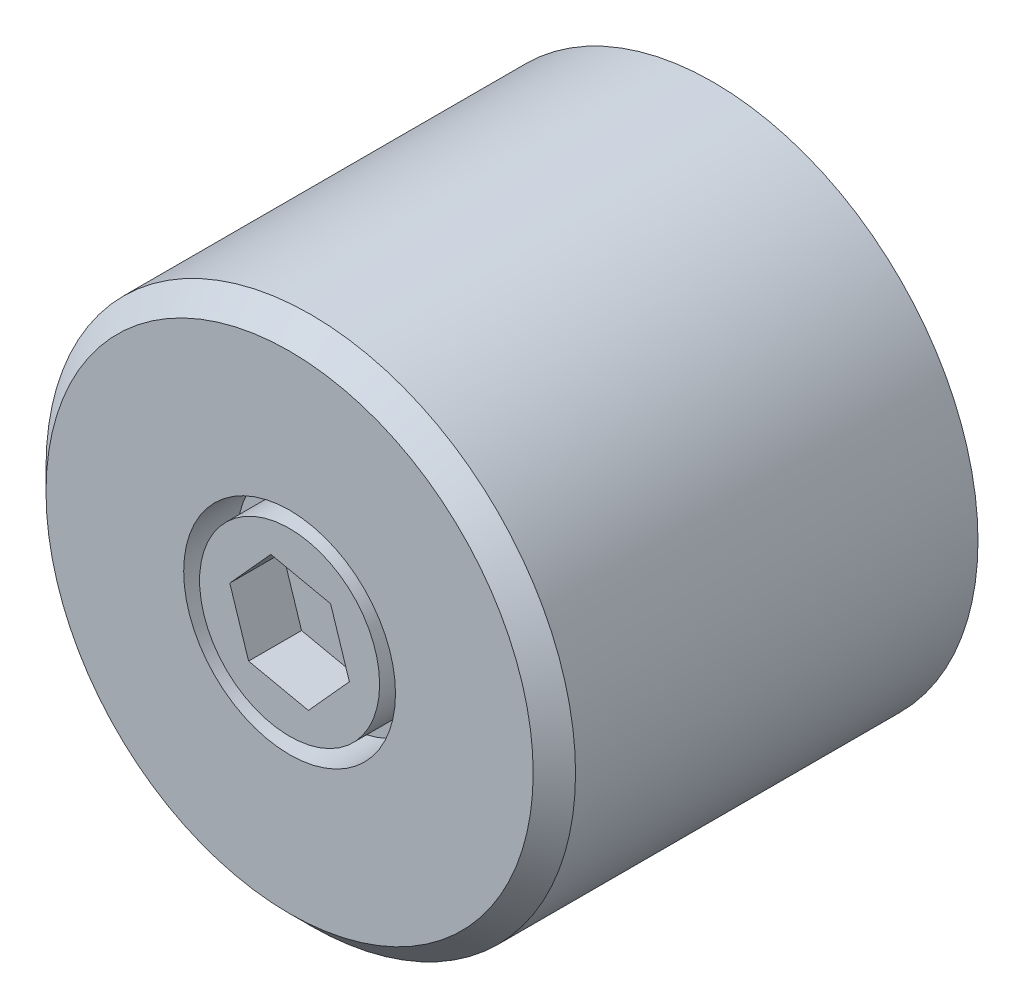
ISO-10303-21;
HEADER;
FILE_DESCRIPTION(('STEP AP214'),'2;1');
FILE_NAME('part.step','',(''),(''),'','','');
FILE_SCHEMA(('AUTOMOTIVE_DESIGN { 1 0 10303 214 1 1 1 1 }'));
ENDSEC;
DATA;
#1=APPLICATION_CONTEXT('core data for automotive mechanical design processes');
#2=APPLICATION_PROTOCOL_DEFINITION('international standard','automotive_design',2000,#1);
#3=PRODUCT_CONTEXT('',#1,'mechanical');
#4=PRODUCT('Part','Part','',(#3));
#5=PRODUCT_RELATED_PRODUCT_CATEGORY('part','',(#4));
#6=PRODUCT_DEFINITION_FORMATION('','',#4);
#7=PRODUCT_DEFINITION_CONTEXT('part definition',#1,'design');
#8=PRODUCT_DEFINITION('design','',#6,#7);
#9=PRODUCT_DEFINITION_SHAPE('','',#8);
#10=(LENGTH_UNIT() NAMED_UNIT(*) SI_UNIT(.MILLI.,.METRE.));
#11=(NAMED_UNIT(*) PLANE_ANGLE_UNIT() SI_UNIT($,.RADIAN.));
#12=(NAMED_UNIT(*) SI_UNIT($,.STERADIAN.) SOLID_ANGLE_UNIT());
#13=UNCERTAINTY_MEASURE_WITH_UNIT(LENGTH_MEASURE(1.E-05),#10,'distance_accuracy_value','');
#14=(GEOMETRIC_REPRESENTATION_CONTEXT(3) GLOBAL_UNCERTAINTY_ASSIGNED_CONTEXT((#13)) GLOBAL_UNIT_ASSIGNED_CONTEXT((#10,
#11,#12)) REPRESENTATION_CONTEXT('',''));
#15=CARTESIAN_POINT('',(0.,0.,0.));
#16=DIRECTION('',(0.,0.,1.));
#17=DIRECTION('',(1.,0.,0.));
#18=AXIS2_PLACEMENT_3D('',#15,#16,#17);
#19=CARTESIAN_POINT('',(0.,0.,40.));
#20=DIRECTION('',(0.,0.,-1.));
#21=DIRECTION('',(-1.,0.,0.));
#22=AXIS2_PLACEMENT_3D('',#19,#20,#21);
#23=CYLINDRICAL_SURFACE('',#22,25.);
#24=CARTESIAN_POINT('',(0.,0.,38.));
#25=DIRECTION('',(0.,0.,1.));
#26=DIRECTION('',(1.,0.,0.));
#27=AXIS2_PLACEMENT_3D('',#24,#25,#26);
#28=CIRCLE('',#27,25.);
#29=CARTESIAN_POINT('',(25.,0.,38.));
#30=VERTEX_POINT('',#29);
#31=EDGE_CURVE('E12',#30,#30,#28,.F.);
#32=ORIENTED_EDGE('',*,*,#31,.T.);
#33=EDGE_LOOP('',(#32));
#34=FACE_BOUND('',#33,.T.);
#35=CARTESIAN_POINT('',(0.,0.,0.));
#36=DIRECTION('',(0.,0.,1.));
#37=DIRECTION('',(1.,0.,0.));
#38=AXIS2_PLACEMENT_3D('',#35,#36,#37);
#39=CIRCLE('',#38,25.);
#40=CARTESIAN_POINT('',(25.,0.,0.));
#41=VERTEX_POINT('',#40);
#42=EDGE_CURVE('E200',#41,#41,#39,.T.);
#43=ORIENTED_EDGE('',*,*,#42,.T.);
#44=EDGE_LOOP('',(#43));
#45=FACE_BOUND('',#44,.T.);
#46=ADVANCED_FACE('F84',(#34,#45),#23,.T.);
#47=CARTESIAN_POINT('',(0.,0.,40.));
#48=DIRECTION('',(0.,0.,1.));
#49=DIRECTION('',(1.,0.,0.));
#50=AXIS2_PLACEMENT_3D('',#47,#48,#49);
#51=PLANE('',#50);
#52=CARTESIAN_POINT('',(0.,0.,40.));
#53=DIRECTION('',(0.,0.,1.));
#54=DIRECTION('',(1.,0.,0.));
#55=AXIS2_PLACEMENT_3D('',#52,#53,#54);
#56=CIRCLE('',#55,23.);
#57=CARTESIAN_POINT('',(23.,0.,40.));
#58=VERTEX_POINT('',#57);
#59=EDGE_CURVE('E92',#58,#58,#56,.T.);
#60=ORIENTED_EDGE('',*,*,#59,.T.);
#61=EDGE_LOOP('',(#60));
#62=FACE_BOUND('',#61,.T.);
#63=CARTESIAN_POINT('',(0.,0.,40.));
#64=DIRECTION('',(0.,0.,1.));
#65=DIRECTION('',(1.,0.,0.));
#66=AXIS2_PLACEMENT_3D('',#63,#64,#65);
#67=CIRCLE('',#66,10.);
#68=CARTESIAN_POINT('',(10.,0.,40.));
#69=VERTEX_POINT('',#68);
#70=EDGE_CURVE('E194',#69,#69,#67,.T.);
#71=ORIENTED_EDGE('',*,*,#70,.F.);
#72=EDGE_LOOP('',(#71));
#73=FACE_BOUND('',#72,.T.);
#74=ADVANCED_FACE('F207',(#62,#73),#51,.T.);
#75=CARTESIAN_POINT('',(0.,0.,0.));
#76=DIRECTION('',(0.,0.,1.));
#77=DIRECTION('',(1.,0.,0.));
#78=AXIS2_PLACEMENT_3D('',#75,#76,#77);
#79=PLANE('',#78);
#80=ORIENTED_EDGE('',*,*,#42,.F.);
#81=EDGE_LOOP('',(#80));
#82=FACE_BOUND('',#81,.T.);
#83=ADVANCED_FACE('F225',(#82),#79,.F.);
#84=CARTESIAN_POINT('',(0.,0.,35.));
#85=DIRECTION('',(0.,0.,1.));
#86=DIRECTION('',(1.,0.,0.));
#87=AXIS2_PLACEMENT_3D('',#84,#85,#86);
#88=CYLINDRICAL_SURFACE('',#87,10.);
#89=CARTESIAN_POINT('',(0.,0.,35.));
#90=DIRECTION('',(0.,0.,1.));
#91=DIRECTION('',(1.,0.,0.));
#92=AXIS2_PLACEMENT_3D('',#89,#90,#91);
#93=CIRCLE('',#92,10.);
#94=CARTESIAN_POINT('',(10.,0.,35.));
#95=VERTEX_POINT('',#94);
#96=EDGE_CURVE('E197',#95,#95,#93,.T.);
#97=ORIENTED_EDGE('',*,*,#96,.F.);
#98=EDGE_LOOP('',(#97));
#99=FACE_BOUND('',#98,.T.);
#100=ORIENTED_EDGE('',*,*,#70,.T.);
#101=EDGE_LOOP('',(#100));
#102=FACE_BOUND('',#101,.T.);
#103=ADVANCED_FACE('F230',(#99,#102),#88,.F.);
#104=CARTESIAN_POINT('',(0.,0.,35.));
#105=DIRECTION('',(0.,0.,1.));
#106=DIRECTION('',(1.,0.,0.));
#107=AXIS2_PLACEMENT_3D('',#104,#105,#106);
#108=PLANE('',#107);
#109=CARTESIAN_POINT('',(0.,0.,35.));
#110=DIRECTION('',(0.,0.,1.));
#111=DIRECTION('',(1.,0.,0.));
#112=AXIS2_PLACEMENT_3D('',#109,#110,#111);
#113=CIRCLE('',#112,8.5);
#114=CARTESIAN_POINT('',(8.5,0.,35.));
#115=VERTEX_POINT('',#114);
#116=EDGE_CURVE('E191',#115,#115,#113,.T.);
#117=ORIENTED_EDGE('',*,*,#116,.F.);
#118=EDGE_LOOP('',(#117));
#119=FACE_BOUND('',#118,.T.);
#120=ORIENTED_EDGE('',*,*,#96,.T.);
#121=EDGE_LOOP('',(#120));
#122=FACE_BOUND('',#121,.T.);
#123=ADVANCED_FACE('F235',(#119,#122),#108,.T.);
#124=CARTESIAN_POINT('',(0.,0.,35.));
#125=DIRECTION('',(0.,0.,1.));
#126=DIRECTION('',(1.,0.,0.));
#127=AXIS2_PLACEMENT_3D('',#124,#125,#126);
#128=CYLINDRICAL_SURFACE('',#127,8.5);
#129=ORIENTED_EDGE('',*,*,#116,.T.);
#130=EDGE_LOOP('',(#129));
#131=FACE_BOUND('',#130,.T.);
#132=CARTESIAN_POINT('',(0.,0.,40.));
#133=DIRECTION('',(0.,0.,1.));
#134=DIRECTION('',(1.,0.,0.));
#135=AXIS2_PLACEMENT_3D('',#132,#133,#134);
#136=CIRCLE('',#135,8.5);
#137=CARTESIAN_POINT('',(8.5,0.,40.));
#138=VERTEX_POINT('',#137);
#139=EDGE_CURVE('E176',#138,#138,#136,.T.);
#140=ORIENTED_EDGE('',*,*,#139,.F.);
#141=EDGE_LOOP('',(#140));
#142=FACE_BOUND('',#141,.T.);
#143=ADVANCED_FACE('F239',(#131,#142),#128,.T.);
#144=DIRECTION('',(-0.306997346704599,0.951710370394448,0.));
#145=VECTOR('',#144,1.);
#146=CARTESIAN_POINT('',(5.64477685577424,-1.21236445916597,40.));
#147=LINE('',#146,#145);
#148=CARTESIAN_POINT('',(5.64477685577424,-1.21236445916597,40.));
#149=VERTEX_POINT('',#148);
#150=CARTESIAN_POINT('',(3.87232684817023,4.28233792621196,40.));
#151=VERTEX_POINT('',#150);
#152=EDGE_CURVE('E99',#149,#151,#147,.T.);
#153=ORIENTED_EDGE('',*,*,#152,.F.);
#154=DIRECTION('',(0.67070668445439,0.741722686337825,0.));
#155=VECTOR('',#154,1.);
#156=CARTESIAN_POINT('',(1.77245000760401,-5.49470238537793,40.));
#157=LINE('',#156,#155);
#158=CARTESIAN_POINT('',(1.77245000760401,-5.49470238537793,40.));
#159=VERTEX_POINT('',#158);
#160=EDGE_CURVE('E166',#159,#149,#157,.T.);
#161=ORIENTED_EDGE('',*,*,#160,.F.);
#162=DIRECTION('',(0.977704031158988,-0.209987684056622,0.));
#163=VECTOR('',#162,1.);
#164=CARTESIAN_POINT('',(-3.87232684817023,-4.28233792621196,40.));
#165=LINE('',#164,#163);
#166=CARTESIAN_POINT('',(-3.87232684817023,-4.28233792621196,40.));
#167=VERTEX_POINT('',#166);
#168=EDGE_CURVE('E147',#167,#159,#165,.T.);
#169=ORIENTED_EDGE('',*,*,#168,.F.);
#170=DIRECTION('',(0.306997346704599,-0.951710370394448,0.));
#171=VECTOR('',#170,1.);
#172=CARTESIAN_POINT('',(-5.64477685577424,1.21236445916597,40.));
#173=LINE('',#172,#171);
#174=CARTESIAN_POINT('',(-5.64477685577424,1.21236445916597,40.));
#175=VERTEX_POINT('',#174);
#176=EDGE_CURVE('E158',#175,#167,#173,.T.);
#177=ORIENTED_EDGE('',*,*,#176,.F.);
#178=DIRECTION('',(-0.67070668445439,-0.741722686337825,0.));
#179=VECTOR('',#178,1.);
#180=CARTESIAN_POINT('',(-1.77245000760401,5.49470238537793,40.));
#181=LINE('',#180,#179);
#182=CARTESIAN_POINT('',(-1.77245000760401,5.49470238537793,40.));
#183=VERTEX_POINT('',#182);
#184=EDGE_CURVE('E162',#183,#175,#181,.T.);
#185=ORIENTED_EDGE('',*,*,#184,.F.);
#186=DIRECTION('',(-0.977704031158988,0.209987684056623,0.));
#187=VECTOR('',#186,1.);
#188=CARTESIAN_POINT('',(3.87232684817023,4.28233792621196,40.));
#189=LINE('',#188,#187);
#190=EDGE_CURVE('E173',#151,#183,#189,.T.);
#191=ORIENTED_EDGE('',*,*,#190,.F.);
#192=EDGE_LOOP('',(#153,#161,#169,#177,#185,#191));
#193=FACE_BOUND('',#192,.T.);
#194=ORIENTED_EDGE('',*,*,#139,.T.);
#195=EDGE_LOOP('',(#194));
#196=FACE_BOUND('',#195,.T.);
#197=ADVANCED_FACE('F164',(#193,#196),#51,.T.);
#198=CARTESIAN_POINT('',(5.64477685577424,-1.21236445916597,35.));
#199=DIRECTION('',(0.951710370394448,0.306997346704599,0.));
#200=DIRECTION('',(-0.306997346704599,0.951710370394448,0.));
#201=AXIS2_PLACEMENT_3D('',#198,#199,#200);
#202=PLANE('',#201);
#203=ORIENTED_EDGE('',*,*,#152,.T.);
#204=DIRECTION('',(0.,0.,1.));
#205=VECTOR('',#204,1.);
#206=CARTESIAN_POINT('',(3.87232684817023,4.28233792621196,35.));
#207=LINE('',#206,#205);
#208=CARTESIAN_POINT('',(3.87232684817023,4.28233792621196,35.));
#209=VERTEX_POINT('',#208);
#210=EDGE_CURVE('E131',#209,#151,#207,.T.);
#211=ORIENTED_EDGE('',*,*,#210,.F.);
#212=DIRECTION('',(-0.306997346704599,0.951710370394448,0.));
#213=VECTOR('',#212,1.);
#214=CARTESIAN_POINT('',(5.64477685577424,-1.21236445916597,35.));
#215=LINE('',#214,#213);
#216=CARTESIAN_POINT('',(5.64477685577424,-1.21236445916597,35.));
#217=VERTEX_POINT('',#216);
#218=EDGE_CURVE('E168',#217,#209,#215,.T.);
#219=ORIENTED_EDGE('',*,*,#218,.F.);
#220=DIRECTION('',(0.,0.,1.));
#221=VECTOR('',#220,1.);
#222=CARTESIAN_POINT('',(5.64477685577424,-1.21236445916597,35.));
#223=LINE('',#222,#221);
#224=EDGE_CURVE('E135',#217,#149,#223,.T.);
#225=ORIENTED_EDGE('',*,*,#224,.T.);
#226=EDGE_LOOP('',(#203,#211,#219,#225));
#227=FACE_BOUND('',#226,.T.);
#228=ADVANCED_FACE('F247',(#227),#202,.F.);
#229=CARTESIAN_POINT('',(1.77245000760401,-5.49470238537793,35.));
#230=DIRECTION('',(0.741722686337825,-0.67070668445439,0.));
#231=DIRECTION('',(0.67070668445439,0.741722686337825,0.));
#232=AXIS2_PLACEMENT_3D('',#229,#230,#231);
#233=PLANE('',#232);
#234=ORIENTED_EDGE('',*,*,#160,.T.);
#235=ORIENTED_EDGE('',*,*,#224,.F.);
#236=DIRECTION('',(0.67070668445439,0.741722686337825,0.));
#237=VECTOR('',#236,1.);
#238=CARTESIAN_POINT('',(1.77245000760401,-5.49470238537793,35.));
#239=LINE('',#238,#237);
#240=CARTESIAN_POINT('',(1.77245000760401,-5.49470238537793,35.));
#241=VERTEX_POINT('',#240);
#242=EDGE_CURVE('E177',#241,#217,#239,.T.);
#243=ORIENTED_EDGE('',*,*,#242,.F.);
#244=DIRECTION('',(0.,0.,1.));
#245=VECTOR('',#244,1.);
#246=CARTESIAN_POINT('',(1.77245000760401,-5.49470238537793,35.));
#247=LINE('',#246,#245);
#248=EDGE_CURVE('E155',#241,#159,#247,.T.);
#249=ORIENTED_EDGE('',*,*,#248,.T.);
#250=EDGE_LOOP('',(#234,#235,#243,#249));
#251=FACE_BOUND('',#250,.T.);
#252=ADVANCED_FACE('F244',(#251),#233,.F.);
#253=CARTESIAN_POINT('',(-3.87232684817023,-4.28233792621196,35.));
#254=DIRECTION('',(-0.209987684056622,-0.977704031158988,0.));
#255=DIRECTION('',(0.977704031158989,-0.209987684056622,0.));
#256=AXIS2_PLACEMENT_3D('',#253,#254,#255);
#257=PLANE('',#256);
#258=ORIENTED_EDGE('',*,*,#168,.T.);
#259=ORIENTED_EDGE('',*,*,#248,.F.);
#260=DIRECTION('',(0.977704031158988,-0.209987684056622,0.));
#261=VECTOR('',#260,1.);
#262=CARTESIAN_POINT('',(-3.87232684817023,-4.28233792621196,35.));
#263=LINE('',#262,#261);
#264=CARTESIAN_POINT('',(-3.87232684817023,-4.28233792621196,35.));
#265=VERTEX_POINT('',#264);
#266=EDGE_CURVE('E150',#265,#241,#263,.T.);
#267=ORIENTED_EDGE('',*,*,#266,.F.);
#268=DIRECTION('',(0.,0.,1.));
#269=VECTOR('',#268,1.);
#270=CARTESIAN_POINT('',(-3.87232684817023,-4.28233792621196,35.));
#271=LINE('',#270,#269);
#272=EDGE_CURVE('E143',#265,#167,#271,.T.);
#273=ORIENTED_EDGE('',*,*,#272,.T.);
#274=EDGE_LOOP('',(#258,#259,#267,#273));
#275=FACE_BOUND('',#274,.T.);
#276=ADVANCED_FACE('F145',(#275),#257,.F.);
#277=CARTESIAN_POINT('',(-5.64477685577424,1.21236445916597,35.));
#278=DIRECTION('',(-0.951710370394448,-0.306997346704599,0.));
#279=DIRECTION('',(0.306997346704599,-0.951710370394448,0.));
#280=AXIS2_PLACEMENT_3D('',#277,#278,#279);
#281=PLANE('',#280);
#282=ORIENTED_EDGE('',*,*,#176,.T.);
#283=ORIENTED_EDGE('',*,*,#272,.F.);
#284=DIRECTION('',(0.306997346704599,-0.951710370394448,0.));
#285=VECTOR('',#284,1.);
#286=CARTESIAN_POINT('',(-5.64477685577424,1.21236445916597,35.));
#287=LINE('',#286,#285);
#288=CARTESIAN_POINT('',(-5.64477685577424,1.21236445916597,35.));
#289=VERTEX_POINT('',#288);
#290=EDGE_CURVE('E181',#289,#265,#287,.T.);
#291=ORIENTED_EDGE('',*,*,#290,.F.);
#292=DIRECTION('',(0.,0.,1.));
#293=VECTOR('',#292,1.);
#294=CARTESIAN_POINT('',(-5.64477685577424,1.21236445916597,35.));
#295=LINE('',#294,#293);
#296=EDGE_CURVE('E154',#289,#175,#295,.T.);
#297=ORIENTED_EDGE('',*,*,#296,.T.);
#298=EDGE_LOOP('',(#282,#283,#291,#297));
#299=FACE_BOUND('',#298,.T.);
#300=ADVANCED_FACE('F159',(#299),#281,.F.);
#301=CARTESIAN_POINT('',(-1.77245000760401,5.49470238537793,35.));
#302=DIRECTION('',(-0.741722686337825,0.67070668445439,0.));
#303=DIRECTION('',(-0.67070668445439,-0.741722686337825,0.));
#304=AXIS2_PLACEMENT_3D('',#301,#302,#303);
#305=PLANE('',#304);
#306=ORIENTED_EDGE('',*,*,#184,.T.);
#307=ORIENTED_EDGE('',*,*,#296,.F.);
#308=DIRECTION('',(-0.67070668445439,-0.741722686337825,0.));
#309=VECTOR('',#308,1.);
#310=CARTESIAN_POINT('',(-1.77245000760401,5.49470238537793,35.));
#311=LINE('',#310,#309);
#312=CARTESIAN_POINT('',(-1.77245000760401,5.49470238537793,35.));
#313=VERTEX_POINT('',#312);
#314=EDGE_CURVE('E183',#313,#289,#311,.T.);
#315=ORIENTED_EDGE('',*,*,#314,.F.);
#316=DIRECTION('',(0.,0.,1.));
#317=VECTOR('',#316,1.);
#318=CARTESIAN_POINT('',(-1.77245000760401,5.49470238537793,35.));
#319=LINE('',#318,#317);
#320=EDGE_CURVE('E108',#313,#183,#319,.T.);
#321=ORIENTED_EDGE('',*,*,#320,.T.);
#322=EDGE_LOOP('',(#306,#307,#315,#321));
#323=FACE_BOUND('',#322,.T.);
#324=ADVANCED_FACE('F253',(#323),#305,.F.);
#325=CARTESIAN_POINT('',(3.87232684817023,4.28233792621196,35.));
#326=DIRECTION('',(0.209987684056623,0.977704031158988,0.));
#327=DIRECTION('',(-0.977704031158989,0.209987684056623,0.));
#328=AXIS2_PLACEMENT_3D('',#325,#326,#327);
#329=PLANE('',#328);
#330=ORIENTED_EDGE('',*,*,#190,.T.);
#331=ORIENTED_EDGE('',*,*,#320,.F.);
#332=DIRECTION('',(-0.977704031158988,0.209987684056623,0.));
#333=VECTOR('',#332,1.);
#334=CARTESIAN_POINT('',(3.87232684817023,4.28233792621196,35.));
#335=LINE('',#334,#333);
#336=EDGE_CURVE('E186',#209,#313,#335,.T.);
#337=ORIENTED_EDGE('',*,*,#336,.F.);
#338=ORIENTED_EDGE('',*,*,#210,.T.);
#339=EDGE_LOOP('',(#330,#331,#337,#338));
#340=FACE_BOUND('',#339,.T.);
#341=ADVANCED_FACE('F216',(#340),#329,.F.);
#342=CARTESIAN_POINT('',(2.09987684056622,9.77704031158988,35.));
#343=DIRECTION('',(0.,0.,1.));
#344=DIRECTION('',(1.,0.,0.));
#345=AXIS2_PLACEMENT_3D('',#342,#343,#344);
#346=PLANE('',#345);
#347=ORIENTED_EDGE('',*,*,#218,.T.);
#348=ORIENTED_EDGE('',*,*,#336,.T.);
#349=ORIENTED_EDGE('',*,*,#314,.T.);
#350=ORIENTED_EDGE('',*,*,#290,.T.);
#351=ORIENTED_EDGE('',*,*,#266,.T.);
#352=ORIENTED_EDGE('',*,*,#242,.T.);
#353=EDGE_LOOP('',(#347,#348,#349,#350,#351,#352));
#354=FACE_BOUND('',#353,.T.);
#355=ADVANCED_FACE('F211',(#354),#346,.T.);
#356=CARTESIAN_POINT('',(0.,0.,40.));
#357=DIRECTION('',(0.,0.,-1.));
#358=DIRECTION('',(-1.,0.,0.));
#359=AXIS2_PLACEMENT_3D('',#356,#357,#358);
#360=CONICAL_SURFACE('',#359,23.,0.785398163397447);
#361=ORIENTED_EDGE('',*,*,#31,.F.);
#362=EDGE_LOOP('',(#361));
#363=FACE_BOUND('',#362,.T.);
#364=ORIENTED_EDGE('',*,*,#59,.F.);
#365=EDGE_LOOP('',(#364));
#366=FACE_BOUND('',#365,.T.);
#367=ADVANCED_FACE('F86',(#363,#366),#360,.T.);
#368=CLOSED_SHELL('',(#46,#74,#83,#103,#123,#143,#197,#228,#252,#276,#300,#324,#341,#355,#367));
#369=MANIFOLD_SOLID_BREP('B2',#368);
#370=ADVANCED_BREP_SHAPE_REPRESENTATION('',(#18,#369),#14);
#371=SHAPE_DEFINITION_REPRESENTATION(#9,#370);
ENDSEC;
END-ISO-10303-21;
